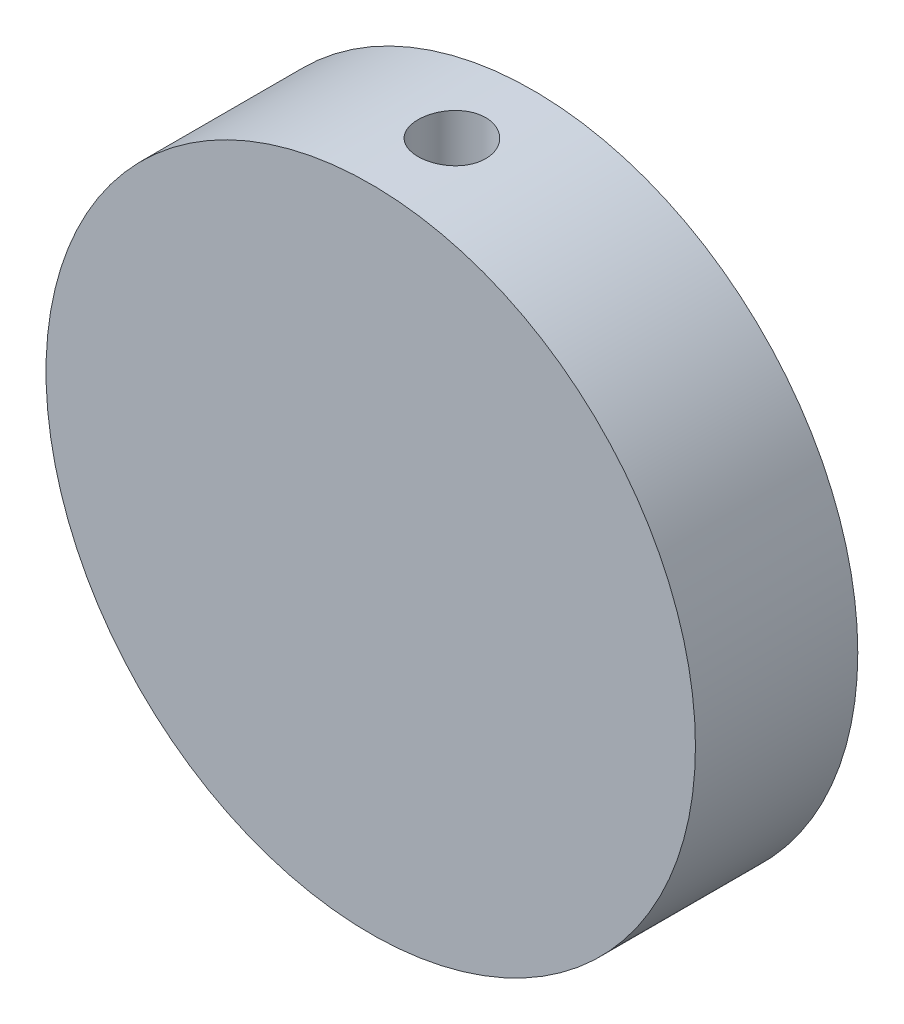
from build123d import *

# Parameters (mm, degrees)
ESQUISSE1_R             = 12
BASE_EXTRUSION_DEPTH    = 6
ESQUISSE2_R             = 1.25
ENL_V_MAT_EXTRU_1_DEPTH = 14


with BuildPart() as part:
    # Esquisse1 → Base-Extrusion (new body)
    with BuildSketch(Plane.XY):
        Circle(ESQUISSE1_R)
    extrude(amount=BASE_EXTRUSION_DEPTH)

    # Esquisse2 → Enl_v. mat.-Extru.1 (cut, symmetric)
    with BuildSketch(Plane(origin=(0, 0, 0), x_dir=(1, 0, 0), z_dir=(0, 1, 0))):
        with Locations(Location((0, -3, 0), (0, 0, 270))):
            Circle(ESQUISSE2_R)
    extrude(amount=ENL_V_MAT_EXTRU_1_DEPTH, both=True, mode=Mode.SUBTRACT)


solid = part.part
